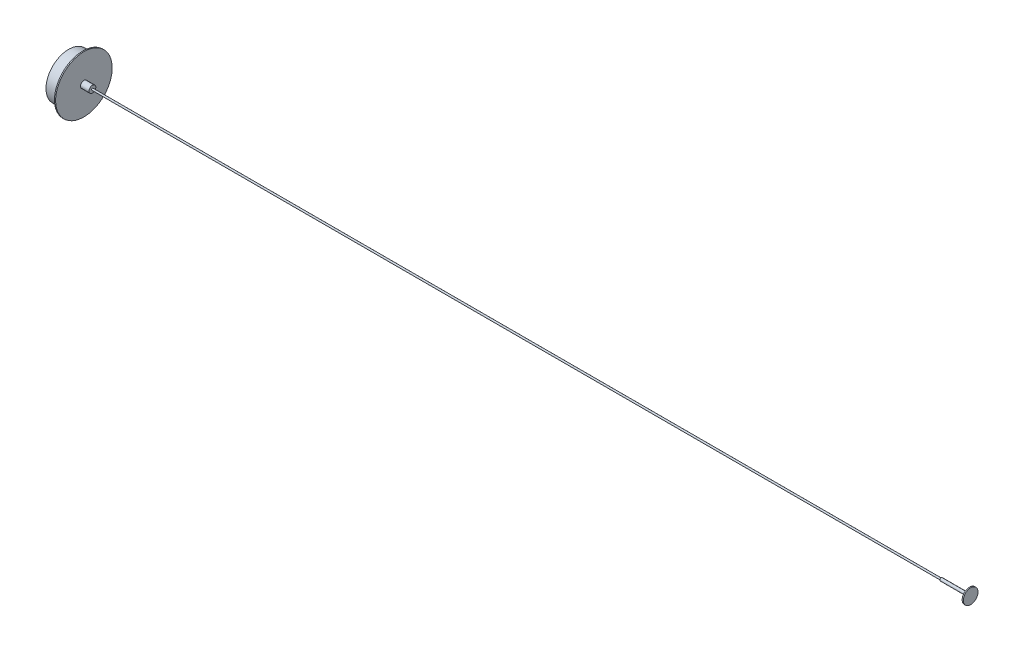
from build123d import *

# Parameters (mm, degrees)
CROQUIS114_R            = 40
SALIENTE_EXTRUIR1_DEPTH = 25
REDONDEO1_R             = 1
CROQUIS115_R            = 50
SALIENTE_EXTRUIR2_DEPTH = 2
CROQUIS122_R            = 6
SALIENTE_EXTRUIR3_DEPTH = 15
CROQUIS123_R            = 1.5
SALIENTE_EXTRUIR4_DEPTH = 1500
CROQUIS124_R            = 2.5
SALIENTE_EXTRUIR5_DEPTH = 50
CROQUIS125_R            = 13
SALIENTE_EXTRUIR6_DEPTH = 2


with BuildPart() as part:
    # Croquis114 → Saliente-Extruir1 (new body)
    with BuildSketch(Plane.ZY):
        with Locations(Location((0, 0, 0), (0, 0, 270))):
            Circle(CROQUIS114_R)
    extrude(amount=SALIENTE_EXTRUIR1_DEPTH)

    # Redondeo1
    redondeo1_edges = [part.edges().sort_by_distance(p)[0] for p in [
        (0, 40, 0),
    ]]
    fillet(redondeo1_edges, radius=REDONDEO1_R)

    # Croquis115 → Saliente-Extruir2 (add)
    with BuildSketch(Plane(origin=(0, 0, 0), x_dir=(0, 0, -1), z_dir=(1, 0, 0))):
        with Locations(Location((0, 0, 0), (0, 0, 90))):
            Circle(CROQUIS115_R)
    extrude(amount=SALIENTE_EXTRUIR2_DEPTH)


with BuildPart() as body_2:
    # Croquis122 → Saliente-Extruir3 (new body)
    with BuildSketch(Plane(origin=(2, 0, 0), x_dir=(0, 0, -1), z_dir=(1, 0, 0))):
        with Locations(Location((0, 0, 0), (0, 0, 90))):
            Circle(CROQUIS122_R)
    extrude(amount=SALIENTE_EXTRUIR3_DEPTH)


with BuildPart() as body_3:
    # Croquis123 → Saliente-Extruir4 (new body)
    with BuildSketch(Plane(origin=(17, 0, 0), x_dir=(0, 0, -1), z_dir=(1, 0, 0))):
        with Locations(Location((0, 0, 0), (0, 0, 90))):
            Circle(CROQUIS123_R)
    extrude(amount=SALIENTE_EXTRUIR4_DEPTH)


with BuildPart() as body_4:
    # Croquis124 → Saliente-Extruir5 (new body)
    with BuildSketch(Plane(origin=(1517, 0, 0), x_dir=(0, 0, -1), z_dir=(1, 0, 0))):
        with Locations(Location((0, 0, 0), (0, 0, 90))):
            Circle(CROQUIS124_R)
    extrude(amount=SALIENTE_EXTRUIR5_DEPTH)

    # Croquis125 → Saliente-Extruir6 (add)
    with BuildSketch(Plane(origin=(1567, 0, 0), x_dir=(0, 0, -1), z_dir=(1, 0, 0))):
        with Locations(Location((0, 0, 0), (0, 0, 90))):
            Circle(CROQUIS125_R)
    extrude(amount=SALIENTE_EXTRUIR6_DEPTH)


solid = Compound([part.part, body_2.part, body_3.part, body_4.part])
